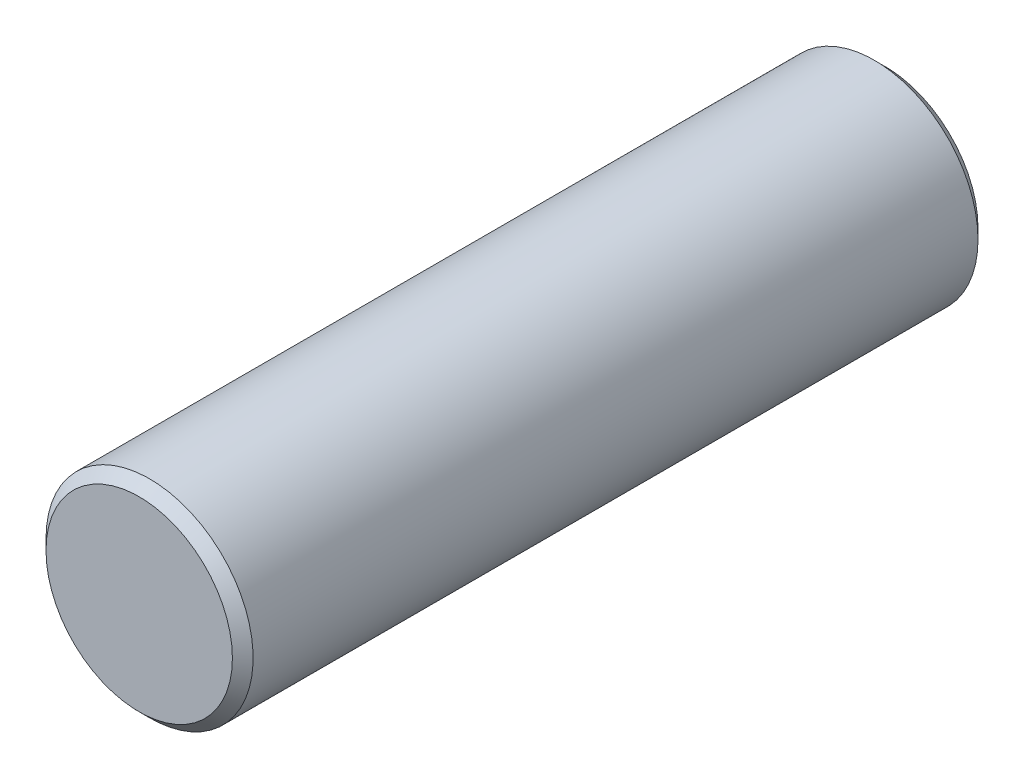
from build123d import *

# Parameters (mm, degrees)
SKETCH_1_R      = 1
EXTRUDE_1_DEPTH = 3.6
CHAMFER_1_SIZE  = 0.1


with BuildPart() as part:
    # Sketch 1 → Extrude 1 (new, symmetric)
    with BuildSketch(Plane.XY):
        Circle(SKETCH_1_R)
    extrude(amount=EXTRUDE_1_DEPTH, both=True)

    # Chamfer 1
    chamfer_1_edges = [part.edges().sort_by_distance(p)[0] for p in [
        (-1, 0, -3.6),
        (-1, 0, 3.6),
    ]]
    chamfer(chamfer_1_edges, length=CHAMFER_1_SIZE)


solid = part.part
